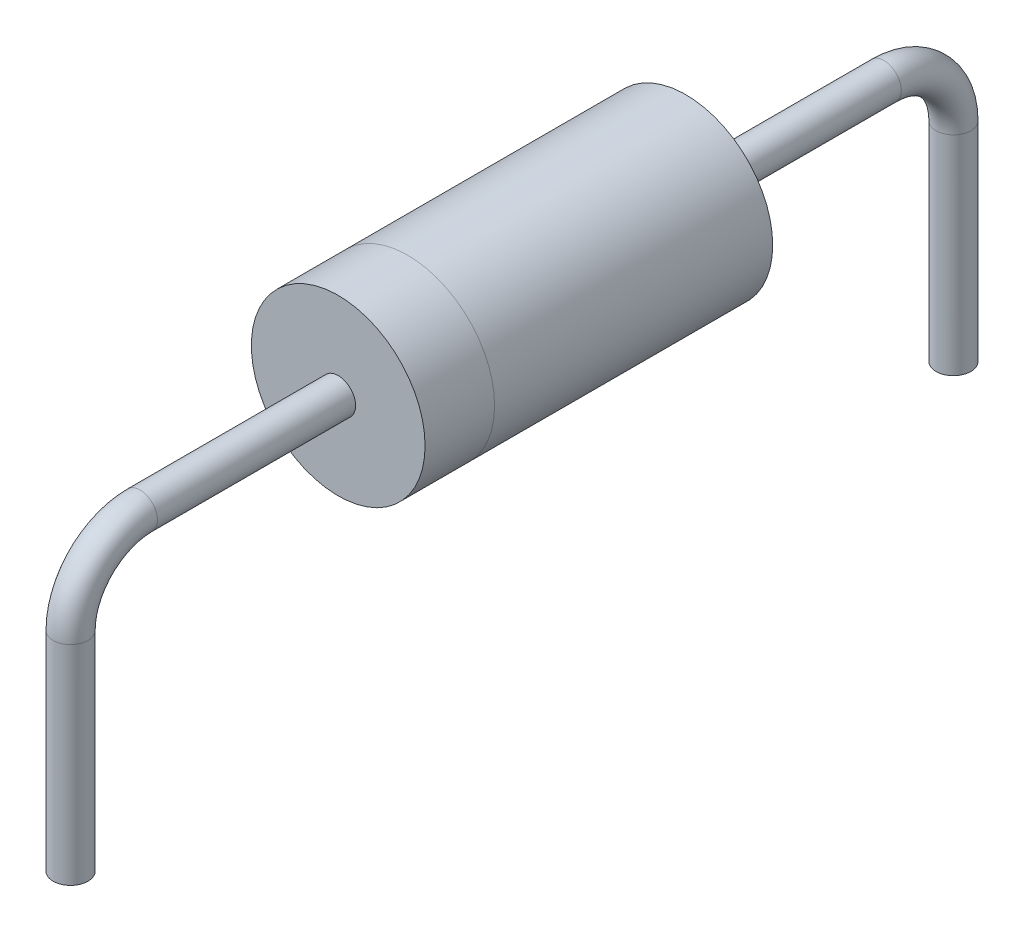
ISO-10303-21;
HEADER;
FILE_DESCRIPTION(('STEP AP214'),'2;1');
FILE_NAME('part.step','',(''),(''),'','','');
FILE_SCHEMA(('AUTOMOTIVE_DESIGN { 1 0 10303 214 1 1 1 1 }'));
ENDSEC;
DATA;
#1=APPLICATION_CONTEXT('core data for automotive mechanical design processes');
#2=APPLICATION_PROTOCOL_DEFINITION('international standard','automotive_design',2000,#1);
#3=PRODUCT_CONTEXT('',#1,'mechanical');
#4=PRODUCT('Part','Part','',(#3));
#5=PRODUCT_RELATED_PRODUCT_CATEGORY('part','',(#4));
#6=PRODUCT_DEFINITION_FORMATION('','',#4);
#7=PRODUCT_DEFINITION_CONTEXT('part definition',#1,'design');
#8=PRODUCT_DEFINITION('design','',#6,#7);
#9=PRODUCT_DEFINITION_SHAPE('','',#8);
#10=(LENGTH_UNIT() NAMED_UNIT(*) SI_UNIT(.MILLI.,.METRE.));
#11=(NAMED_UNIT(*) PLANE_ANGLE_UNIT() SI_UNIT($,.RADIAN.));
#12=(NAMED_UNIT(*) SI_UNIT($,.STERADIAN.) SOLID_ANGLE_UNIT());
#13=UNCERTAINTY_MEASURE_WITH_UNIT(LENGTH_MEASURE(1.E-05),#10,'distance_accuracy_value','');
#14=(GEOMETRIC_REPRESENTATION_CONTEXT(3) GLOBAL_UNCERTAINTY_ASSIGNED_CONTEXT((#13)) GLOBAL_UNIT_ASSIGNED_CONTEXT((#10,
#11,#12)) REPRESENTATION_CONTEXT('',''));
#15=CARTESIAN_POINT('',(0.,0.,0.));
#16=DIRECTION('',(0.,0.,1.));
#17=DIRECTION('',(1.,0.,0.));
#18=AXIS2_PLACEMENT_3D('',#15,#16,#17);
#19=CARTESIAN_POINT('',(0.,0.,5.));
#20=DIRECTION('',(0.,0.,1.));
#21=DIRECTION('',(1.,0.,0.));
#22=AXIS2_PLACEMENT_3D('',#19,#20,#21);
#23=PLANE('',#22);
#24=CARTESIAN_POINT('',(0.,0.,5.));
#25=DIRECTION('',(0.,0.,1.));
#26=DIRECTION('',(1.,0.,0.));
#27=AXIS2_PLACEMENT_3D('',#24,#25,#26);
#28=CIRCLE('',#27,1.2495);
#29=CARTESIAN_POINT('',(1.2495,0.,5.));
#30=VERTEX_POINT('',#29);
#31=EDGE_CURVE('E52',#30,#30,#28,.T.);
#32=ORIENTED_EDGE('',*,*,#31,.T.);
#33=EDGE_LOOP('',(#32));
#34=FACE_BOUND('',#33,.T.);
#35=CARTESIAN_POINT('',(0.,0.,5.));
#36=DIRECTION('',(0.,0.,1.));
#37=DIRECTION('',(1.,0.,0.));
#38=AXIS2_PLACEMENT_3D('',#35,#36,#37);
#39=CIRCLE('',#38,0.25);
#40=CARTESIAN_POINT('',(0.25,0.,5.));
#41=VERTEX_POINT('',#40);
#42=EDGE_CURVE('E105',#41,#41,#39,.T.);
#43=ORIENTED_EDGE('',*,*,#42,.F.);
#44=EDGE_LOOP('',(#43));
#45=FACE_BOUND('',#44,.T.);
#46=ADVANCED_FACE('F37',(#34,#45),#23,.T.);
#47=CARTESIAN_POINT('',(0.,0.,4.));
#48=DIRECTION('',(0.,0.,-1.));
#49=DIRECTION('',(-1.,0.,0.));
#50=AXIS2_PLACEMENT_3D('',#47,#48,#49);
#51=CYLINDRICAL_SURFACE('',#50,1.25);
#52=CARTESIAN_POINT('',(0.,0.,4.));
#53=DIRECTION('',(0.,0.,1.));
#54=DIRECTION('',(1.,0.,0.));
#55=AXIS2_PLACEMENT_3D('',#52,#53,#54);
#56=CIRCLE('',#55,1.2495);
#57=CARTESIAN_POINT('',(1.2495,0.,4.));
#58=VERTEX_POINT('',#57);
#59=EDGE_CURVE('E10',#58,#58,#56,.T.);
#60=ORIENTED_EDGE('',*,*,#59,.F.);
#61=EDGE_LOOP('',(#60));
#62=FACE_BOUND('',#61,.T.);
#63=CARTESIAN_POINT('',(0.,0.,0.));
#64=DIRECTION('',(0.,0.,1.));
#65=DIRECTION('',(1.,0.,0.));
#66=AXIS2_PLACEMENT_3D('',#63,#64,#65);
#67=CIRCLE('',#66,1.25);
#68=CARTESIAN_POINT('',(1.25,0.,0.));
#69=VERTEX_POINT('',#68);
#70=EDGE_CURVE('E47',#69,#69,#67,.T.);
#71=ORIENTED_EDGE('',*,*,#70,.T.);
#72=EDGE_LOOP('',(#71));
#73=FACE_BOUND('',#72,.T.);
#74=ADVANCED_FACE('F39',(#62,#73),#51,.T.);
#75=CARTESIAN_POINT('',(0.,0.,0.));
#76=DIRECTION('',(0.,0.,1.));
#77=DIRECTION('',(1.,0.,0.));
#78=AXIS2_PLACEMENT_3D('',#75,#76,#77);
#79=PLANE('',#78);
#80=CARTESIAN_POINT('',(0.,0.,0.));
#81=DIRECTION('',(0.,0.,1.));
#82=DIRECTION('',(1.,0.,0.));
#83=AXIS2_PLACEMENT_3D('',#80,#81,#82);
#84=CIRCLE('',#83,0.25);
#85=CARTESIAN_POINT('',(0.25,0.,0.));
#86=VERTEX_POINT('',#85);
#87=EDGE_CURVE('E117',#86,#86,#84,.T.);
#88=ORIENTED_EDGE('',*,*,#87,.T.);
#89=EDGE_LOOP('',(#88));
#90=FACE_BOUND('',#89,.T.);
#91=ORIENTED_EDGE('',*,*,#70,.F.);
#92=EDGE_LOOP('',(#91));
#93=FACE_BOUND('',#92,.T.);
#94=ADVANCED_FACE('F65',(#90,#93),#79,.F.);
#95=CARTESIAN_POINT('',(0.,0.,5.));
#96=DIRECTION('',(0.,0.,-1.));
#97=DIRECTION('',(-1.,0.,0.));
#98=AXIS2_PLACEMENT_3D('',#95,#96,#97);
#99=CYLINDRICAL_SURFACE('',#98,1.2495);
#100=ORIENTED_EDGE('',*,*,#31,.F.);
#101=EDGE_LOOP('',(#100));
#102=FACE_BOUND('',#101,.T.);
#103=ORIENTED_EDGE('',*,*,#59,.T.);
#104=EDGE_LOOP('',(#103));
#105=FACE_BOUND('',#104,.T.);
#106=ADVANCED_FACE('F70',(#102,#105),#99,.T.);
#107=CARTESIAN_POINT('',(0.,-1.,8.85));
#108=DIRECTION('',(0.,-1.,0.));
#109=DIRECTION('',(0.,0.,-1.));
#110=AXIS2_PLACEMENT_3D('',#107,#108,#109);
#111=CYLINDRICAL_SURFACE('',#110,0.25);
#112=CARTESIAN_POINT('',(0.,-1.,8.85));
#113=DIRECTION('',(0.,-1.,0.));
#114=DIRECTION('',(1.,0.,0.));
#115=AXIS2_PLACEMENT_3D('',#112,#113,#114);
#116=CIRCLE('',#115,0.25);
#117=CARTESIAN_POINT('',(0.,-1.,9.1));
#118=VERTEX_POINT('',#117);
#119=EDGE_CURVE('E97',#118,#118,#116,.T.);
#120=ORIENTED_EDGE('',*,*,#119,.T.);
#121=EDGE_LOOP('',(#120));
#122=FACE_BOUND('',#121,.T.);
#123=CARTESIAN_POINT('',(0.,-4.,8.85));
#124=DIRECTION('',(0.,-1.,0.));
#125=DIRECTION('',(1.,0.,0.));
#126=AXIS2_PLACEMENT_3D('',#123,#124,#125);
#127=CIRCLE('',#126,0.25);
#128=CARTESIAN_POINT('',(0.25,-4.,8.85));
#129=VERTEX_POINT('',#128);
#130=EDGE_CURVE('E57',#129,#129,#127,.T.);
#131=ORIENTED_EDGE('',*,*,#130,.F.);
#132=EDGE_LOOP('',(#131));
#133=FACE_BOUND('',#132,.T.);
#134=ADVANCED_FACE('F78',(#122,#133),#111,.T.);
#135=CARTESIAN_POINT('',(0.,-1.,7.85));
#136=DIRECTION('',(1.,0.,0.));
#137=DIRECTION('',(0.,0.,-1.));
#138=AXIS2_PLACEMENT_3D('',#135,#136,#137);
#139=TOROIDAL_SURFACE('',#138,1.,0.25);
#140=CARTESIAN_POINT('',(0.,0.,7.85));
#141=DIRECTION('',(0.,0.,1.));
#142=DIRECTION('',(1.,0.,0.));
#143=AXIS2_PLACEMENT_3D('',#140,#141,#142);
#144=CIRCLE('',#143,0.25);
#145=CARTESIAN_POINT('',(0.,0.25,7.85));
#146=VERTEX_POINT('',#145);
#147=EDGE_CURVE('E102',#146,#146,#144,.T.);
#148=CARTESIAN_POINT('',(0.,-1.,7.85));
#149=DIRECTION('',(1.,0.,0.));
#150=DIRECTION('',(0.,0.,-1.));
#151=AXIS2_PLACEMENT_3D('',#148,#149,#150);
#152=CIRCLE('',#151,1.25);
#153=EDGE_CURVE('',#146,#118,#152,.T.);
#154=ORIENTED_EDGE('',*,*,#147,.T.);
#155=ORIENTED_EDGE('',*,*,#119,.F.);
#156=ORIENTED_EDGE('',*,*,#153,.T.);
#157=ORIENTED_EDGE('',*,*,#153,.F.);
#158=EDGE_LOOP('',(#154,#156,#155,#157));
#159=FACE_BOUND('',#158,.T.);
#160=ADVANCED_FACE('F86',(#159),#139,.T.);
#161=CARTESIAN_POINT('',(0.,0.,7.85));
#162=DIRECTION('',(0.,0.,-1.));
#163=DIRECTION('',(0.,1.,0.));
#164=AXIS2_PLACEMENT_3D('',#161,#162,#163);
#165=CYLINDRICAL_SURFACE('',#164,0.25);
#166=ORIENTED_EDGE('',*,*,#147,.F.);
#167=EDGE_LOOP('',(#166));
#168=FACE_BOUND('',#167,.T.);
#169=ORIENTED_EDGE('',*,*,#42,.T.);
#170=EDGE_LOOP('',(#169));
#171=FACE_BOUND('',#170,.T.);
#172=ADVANCED_FACE('F92',(#168,#171),#165,.T.);
#173=CARTESIAN_POINT('',(0.,-4.,8.85));
#174=DIRECTION('',(0.,-1.,0.));
#175=DIRECTION('',(1.,0.,0.));
#176=AXIS2_PLACEMENT_3D('',#173,#174,#175);
#177=PLANE('',#176);
#178=ORIENTED_EDGE('',*,*,#130,.T.);
#179=EDGE_LOOP('',(#178));
#180=FACE_BOUND('',#179,.T.);
#181=ADVANCED_FACE('F135',(#180),#177,.T.);
#182=CARTESIAN_POINT('',(0.,-1.,-3.85));
#183=DIRECTION('',(0.,-1.,0.));
#184=DIRECTION('',(0.,0.,-1.));
#185=AXIS2_PLACEMENT_3D('',#182,#183,#184);
#186=CYLINDRICAL_SURFACE('',#185,0.25);
#187=CARTESIAN_POINT('',(0.,-1.,-3.85));
#188=DIRECTION('',(0.,1.,0.));
#189=DIRECTION('',(1.,0.,0.));
#190=AXIS2_PLACEMENT_3D('',#187,#188,#189);
#191=CIRCLE('',#190,0.25);
#192=CARTESIAN_POINT('',(0.,-1.,-4.1));
#193=VERTEX_POINT('',#192);
#194=EDGE_CURVE('E113',#193,#193,#191,.T.);
#195=ORIENTED_EDGE('',*,*,#194,.F.);
#196=EDGE_LOOP('',(#195));
#197=FACE_BOUND('',#196,.T.);
#198=CARTESIAN_POINT('',(0.,-4.,-3.85));
#199=DIRECTION('',(0.,1.,0.));
#200=DIRECTION('',(1.,0.,0.));
#201=AXIS2_PLACEMENT_3D('',#198,#199,#200);
#202=CIRCLE('',#201,0.25);
#203=CARTESIAN_POINT('',(0.25,-4.,-3.85));
#204=VERTEX_POINT('',#203);
#205=EDGE_CURVE('E108',#204,#204,#202,.T.);
#206=ORIENTED_EDGE('',*,*,#205,.T.);
#207=EDGE_LOOP('',(#206));
#208=FACE_BOUND('',#207,.T.);
#209=ADVANCED_FACE('F129',(#197,#208),#186,.T.);
#210=CARTESIAN_POINT('',(0.,-1.,-2.85));
#211=DIRECTION('',(-1.,0.,0.));
#212=DIRECTION('',(0.,0.,1.));
#213=AXIS2_PLACEMENT_3D('',#210,#211,#212);
#214=TOROIDAL_SURFACE('',#213,1.,0.25);
#215=CARTESIAN_POINT('',(0.,0.,-2.85));
#216=DIRECTION('',(0.,0.,1.));
#217=DIRECTION('',(1.,0.,0.));
#218=AXIS2_PLACEMENT_3D('',#215,#216,#217);
#219=CIRCLE('',#218,0.25);
#220=CARTESIAN_POINT('',(0.,0.25,-2.85));
#221=VERTEX_POINT('',#220);
#222=EDGE_CURVE('E116',#221,#221,#219,.T.);
#223=CARTESIAN_POINT('',(0.,-1.,-2.85));
#224=DIRECTION('',(-1.,0.,0.));
#225=DIRECTION('',(0.,0.,1.));
#226=AXIS2_PLACEMENT_3D('',#223,#224,#225);
#227=CIRCLE('',#226,1.25);
#228=EDGE_CURVE('',#221,#193,#227,.T.);
#229=ORIENTED_EDGE('',*,*,#222,.F.);
#230=ORIENTED_EDGE('',*,*,#194,.T.);
#231=ORIENTED_EDGE('',*,*,#228,.T.);
#232=ORIENTED_EDGE('',*,*,#228,.F.);
#233=EDGE_LOOP('',(#229,#231,#230,#232));
#234=FACE_BOUND('',#233,.T.);
#235=ADVANCED_FACE('F126',(#234),#214,.T.);
#236=CARTESIAN_POINT('',(0.,0.,-2.85));
#237=DIRECTION('',(0.,0.,1.));
#238=DIRECTION('',(0.,-1.,0.));
#239=AXIS2_PLACEMENT_3D('',#236,#237,#238);
#240=CYLINDRICAL_SURFACE('',#239,0.25);
#241=ORIENTED_EDGE('',*,*,#222,.T.);
#242=EDGE_LOOP('',(#241));
#243=FACE_BOUND('',#242,.T.);
#244=ORIENTED_EDGE('',*,*,#87,.F.);
#245=EDGE_LOOP('',(#244));
#246=FACE_BOUND('',#245,.T.);
#247=ADVANCED_FACE('F123',(#243,#246),#240,.T.);
#248=CARTESIAN_POINT('',(0.,-4.,-3.85));
#249=DIRECTION('',(0.,-1.,0.));
#250=DIRECTION('',(1.,0.,0.));
#251=AXIS2_PLACEMENT_3D('',#248,#249,#250);
#252=PLANE('',#251);
#253=ORIENTED_EDGE('',*,*,#205,.F.);
#254=EDGE_LOOP('',(#253));
#255=FACE_BOUND('',#254,.T.);
#256=ADVANCED_FACE('F139',(#255),#252,.T.);
#257=CLOSED_SHELL('',(#46,#74,#94,#106,#134,#160,#172,#181,#209,#235,#247,#256));
#258=MANIFOLD_SOLID_BREP('B2',#257);
#259=ADVANCED_BREP_SHAPE_REPRESENTATION('',(#18,#258),#14);
#260=SHAPE_DEFINITION_REPRESENTATION(#9,#259);
ENDSEC;
END-ISO-10303-21;
